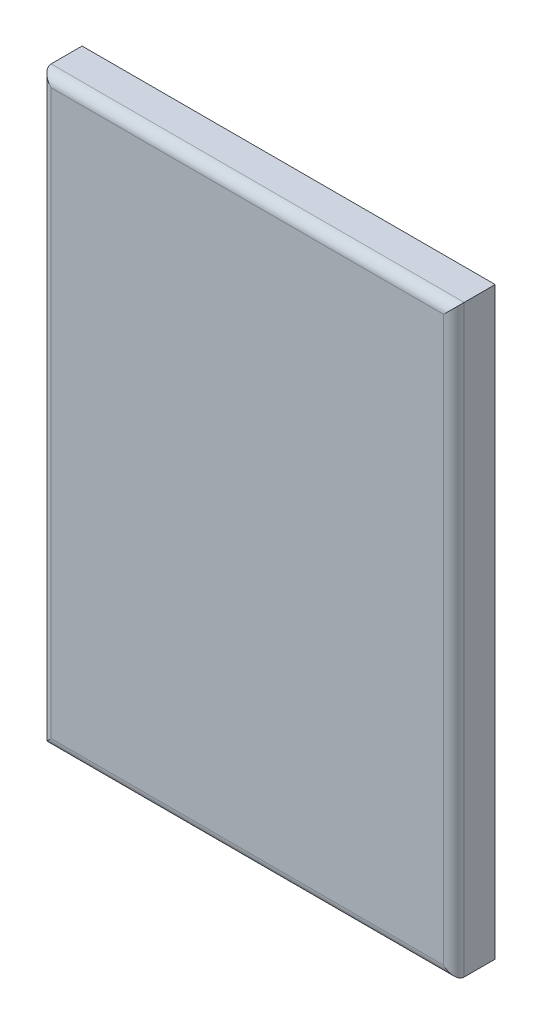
from build123d import *

# Parameters (mm, degrees)
CROQUIS1_W     = 40
CROQUIS1_H     = 56.57
EXTRUIR1_DEPTH = 4
REDONDEO1_R    = 1


with BuildPart() as part:
    # Croquis1 → Extruir1 (new body)
    with BuildSketch(Plane.XY):
        with Locations((20, 28.285)):
            Rectangle(CROQUIS1_W, CROQUIS1_H)
    extrude(amount=EXTRUIR1_DEPTH)

    # Redondeo1
    redondeo1_edges = [part.edges().sort_by_distance(p)[0] for p in [
        (0, 28.285, 4),
        (20, 0, 4),
        (40, 28.285, 4),
        (20, 56.57, 4),
    ]]
    fillet(redondeo1_edges, radius=REDONDEO1_R)


solid = part.part
